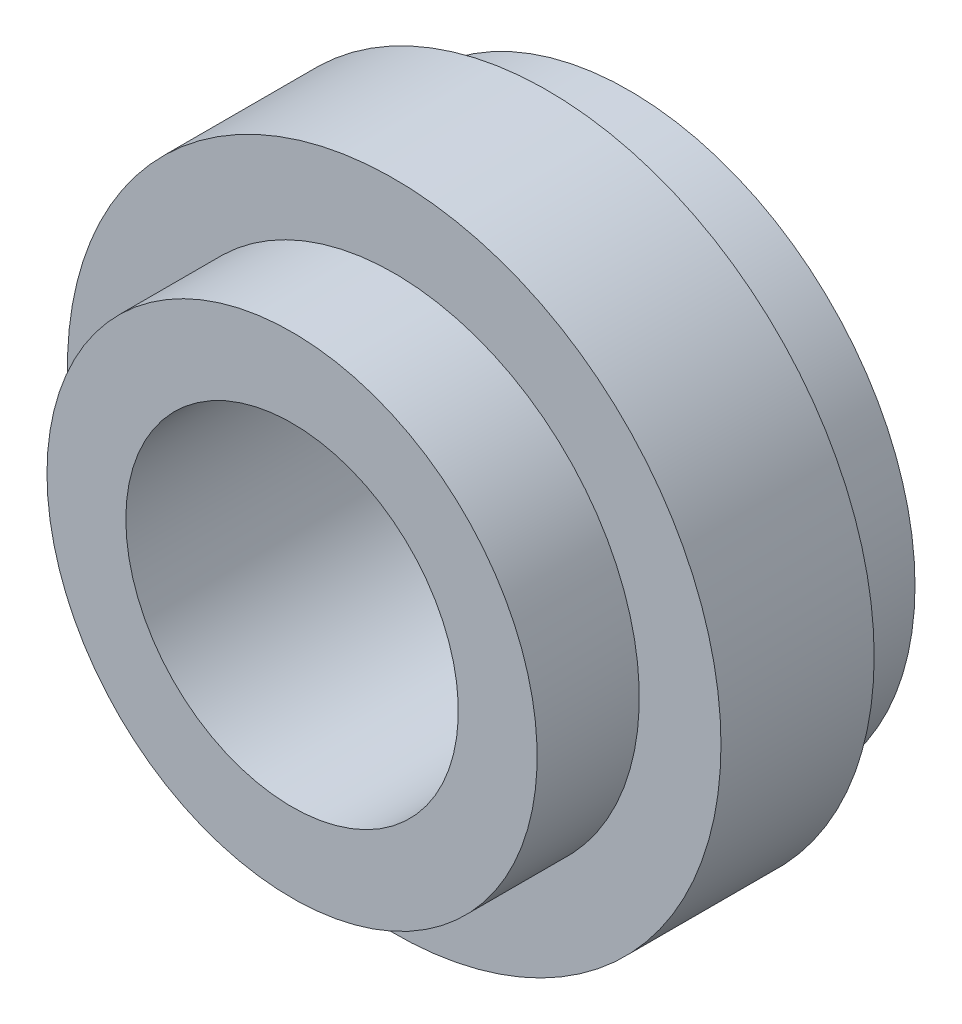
ISO-10303-21;
HEADER;
FILE_DESCRIPTION(('STEP AP214'),'2;1');
FILE_NAME('part.step','',(''),(''),'','','');
FILE_SCHEMA(('AUTOMOTIVE_DESIGN { 1 0 10303 214 1 1 1 1 }'));
ENDSEC;
DATA;
#1=APPLICATION_CONTEXT('core data for automotive mechanical design processes');
#2=APPLICATION_PROTOCOL_DEFINITION('international standard','automotive_design',2000,#1);
#3=PRODUCT_CONTEXT('',#1,'mechanical');
#4=PRODUCT('Part','Part','',(#3));
#5=PRODUCT_RELATED_PRODUCT_CATEGORY('part','',(#4));
#6=PRODUCT_DEFINITION_FORMATION('','',#4);
#7=PRODUCT_DEFINITION_CONTEXT('part definition',#1,'design');
#8=PRODUCT_DEFINITION('design','',#6,#7);
#9=PRODUCT_DEFINITION_SHAPE('','',#8);
#10=(LENGTH_UNIT() NAMED_UNIT(*) SI_UNIT(.MILLI.,.METRE.));
#11=(NAMED_UNIT(*) PLANE_ANGLE_UNIT() SI_UNIT($,.RADIAN.));
#12=(NAMED_UNIT(*) SI_UNIT($,.STERADIAN.) SOLID_ANGLE_UNIT());
#13=UNCERTAINTY_MEASURE_WITH_UNIT(LENGTH_MEASURE(1.E-05),#10,'distance_accuracy_value','');
#14=(GEOMETRIC_REPRESENTATION_CONTEXT(3) GLOBAL_UNCERTAINTY_ASSIGNED_CONTEXT((#13)) GLOBAL_UNIT_ASSIGNED_CONTEXT((#10,
#11,#12)) REPRESENTATION_CONTEXT('',''));
#15=CARTESIAN_POINT('',(0.,0.,0.));
#16=DIRECTION('',(0.,0.,1.));
#17=DIRECTION('',(1.,0.,0.));
#18=AXIS2_PLACEMENT_3D('',#15,#16,#17);
#19=CARTESIAN_POINT('',(0.,0.,-5.75));
#20=DIRECTION('',(0.,0.,-1.));
#21=DIRECTION('',(-1.,0.,0.));
#22=AXIS2_PLACEMENT_3D('',#19,#20,#21);
#23=PLANE('',#22);
#24=CARTESIAN_POINT('',(0.,0.,-5.75));
#25=DIRECTION('',(0.,0.,-1.));
#26=DIRECTION('',(-1.,0.,0.));
#27=AXIS2_PLACEMENT_3D('',#24,#25,#26);
#28=CIRCLE('',#27,4.07);
#29=CARTESIAN_POINT('',(-4.07,0.,-5.75));
#30=VERTEX_POINT('',#29);
#31=EDGE_CURVE('E370',#30,#30,#28,.T.);
#32=ORIENTED_EDGE('',*,*,#31,.F.);
#33=EDGE_LOOP('',(#32));
#34=FACE_BOUND('',#33,.T.);
#35=CARTESIAN_POINT('',(0.,0.,-5.75));
#36=DIRECTION('',(0.,0.,1.));
#37=DIRECTION('',(1.,0.,0.));
#38=AXIS2_PLACEMENT_3D('',#35,#36,#37);
#39=CIRCLE('',#38,7.);
#40=CARTESIAN_POINT('',(7.,0.,-5.75));
#41=VERTEX_POINT('',#40);
#42=EDGE_CURVE('E376',#41,#41,#39,.T.);
#43=ORIENTED_EDGE('',*,*,#42,.F.);
#44=EDGE_LOOP('',(#43));
#45=FACE_BOUND('',#44,.T.);
#46=ADVANCED_FACE('F350',(#34,#45),#23,.T.);
#47=CARTESIAN_POINT('',(0.,0.,-5.75));
#48=DIRECTION('',(0.,0.,1.));
#49=DIRECTION('',(1.,0.,0.));
#50=AXIS2_PLACEMENT_3D('',#47,#48,#49);
#51=CYLINDRICAL_SURFACE('',#50,8.);
#52=CARTESIAN_POINT('',(0.,0.,0.));
#53=DIRECTION('',(0.,0.,-1.));
#54=DIRECTION('',(-1.,0.,0.));
#55=AXIS2_PLACEMENT_3D('',#52,#53,#54);
#56=CIRCLE('',#55,8.);
#57=CARTESIAN_POINT('',(8.,0.,0.));
#58=VERTEX_POINT('',#57);
#59=EDGE_CURVE('E365',#58,#58,#56,.T.);
#60=CARTESIAN_POINT('',(0.,0.,-3.75));
#61=DIRECTION('',(0.,0.,1.));
#62=DIRECTION('',(1.,0.,0.));
#63=AXIS2_PLACEMENT_3D('',#60,#61,#62);
#64=CIRCLE('',#63,8.);
#65=CARTESIAN_POINT('',(8.,0.,-3.75));
#66=VERTEX_POINT('',#65);
#67=EDGE_CURVE('E379',#66,#66,#64,.T.);
#68=CARTESIAN_POINT('',(8.,0.,0.));
#69=CARTESIAN_POINT('',(8.,0.,-0.0390624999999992));
#70=CARTESIAN_POINT('',(8.,0.,-0.0781249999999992));
#71=CARTESIAN_POINT('',(8.,0.,-0.156249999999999));
#72=CARTESIAN_POINT('',(8.,0.,-0.195312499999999));
#73=CARTESIAN_POINT('',(8.,0.,-0.273437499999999));
#74=CARTESIAN_POINT('',(8.,0.,-0.312499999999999));
#75=CARTESIAN_POINT('',(8.,0.,-0.390625));
#76=CARTESIAN_POINT('',(8.,0.,-0.4296875));
#77=CARTESIAN_POINT('',(8.,0.,-0.5078125));
#78=CARTESIAN_POINT('',(8.,0.,-0.546875));
#79=CARTESIAN_POINT('',(8.,0.,-0.625));
#80=CARTESIAN_POINT('',(8.,0.,-0.6640625));
#81=CARTESIAN_POINT('',(8.,0.,-0.7421875));
#82=CARTESIAN_POINT('',(8.,0.,-0.78125));
#83=CARTESIAN_POINT('',(8.,0.,-0.859375));
#84=CARTESIAN_POINT('',(8.,0.,-0.898437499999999));
#85=CARTESIAN_POINT('',(8.,0.,-0.976562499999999));
#86=CARTESIAN_POINT('',(8.,0.,-1.015625));
#87=CARTESIAN_POINT('',(8.,0.,-1.09375));
#88=CARTESIAN_POINT('',(8.,0.,-1.1328125));
#89=CARTESIAN_POINT('',(8.,0.,-1.2109375));
#90=CARTESIAN_POINT('',(8.,0.,-1.25));
#91=CARTESIAN_POINT('',(8.,0.,-1.328125));
#92=CARTESIAN_POINT('',(8.,0.,-1.3671875));
#93=CARTESIAN_POINT('',(8.,0.,-1.4453125));
#94=CARTESIAN_POINT('',(8.,0.,-1.484375));
#95=CARTESIAN_POINT('',(8.,0.,-1.5625));
#96=CARTESIAN_POINT('',(8.,0.,-1.6015625));
#97=CARTESIAN_POINT('',(8.,0.,-1.6796875));
#98=CARTESIAN_POINT('',(8.,0.,-1.71875));
#99=CARTESIAN_POINT('',(8.,0.,-1.796875));
#100=CARTESIAN_POINT('',(8.,0.,-1.8359375));
#101=CARTESIAN_POINT('',(8.,0.,-1.9140625));
#102=CARTESIAN_POINT('',(8.,0.,-1.953125));
#103=CARTESIAN_POINT('',(8.,0.,-2.03125));
#104=CARTESIAN_POINT('',(8.,0.,-2.0703125));
#105=CARTESIAN_POINT('',(8.,0.,-2.1484375));
#106=CARTESIAN_POINT('',(8.,0.,-2.1875));
#107=CARTESIAN_POINT('',(8.,0.,-2.265625));
#108=CARTESIAN_POINT('',(8.,0.,-2.3046875));
#109=CARTESIAN_POINT('',(8.,0.,-2.3828125));
#110=CARTESIAN_POINT('',(8.,0.,-2.421875));
#111=CARTESIAN_POINT('',(8.,0.,-2.5));
#112=CARTESIAN_POINT('',(8.,0.,-2.5390625));
#113=CARTESIAN_POINT('',(8.,0.,-2.6171875));
#114=CARTESIAN_POINT('',(8.,0.,-2.65625));
#115=CARTESIAN_POINT('',(8.,0.,-2.734375));
#116=CARTESIAN_POINT('',(8.,0.,-2.7734375));
#117=CARTESIAN_POINT('',(8.,0.,-2.8515625));
#118=CARTESIAN_POINT('',(8.,0.,-2.890625));
#119=CARTESIAN_POINT('',(8.,0.,-2.96875));
#120=CARTESIAN_POINT('',(8.,0.,-3.0078125));
#121=CARTESIAN_POINT('',(8.,0.,-3.0859375));
#122=CARTESIAN_POINT('',(8.,0.,-3.125));
#123=CARTESIAN_POINT('',(8.,0.,-3.203125));
#124=CARTESIAN_POINT('',(8.,0.,-3.2421875));
#125=CARTESIAN_POINT('',(8.,0.,-3.3203125));
#126=CARTESIAN_POINT('',(8.,0.,-3.359375));
#127=CARTESIAN_POINT('',(8.,0.,-3.4375));
#128=CARTESIAN_POINT('',(8.,0.,-3.4765625));
#129=CARTESIAN_POINT('',(8.,0.,-3.5546875));
#130=CARTESIAN_POINT('',(8.,0.,-3.59375));
#131=CARTESIAN_POINT('',(8.,0.,-3.671875));
#132=CARTESIAN_POINT('',(8.,0.,-3.7109375));
#133=CARTESIAN_POINT('',(8.,0.,-3.75));
#134=B_SPLINE_CURVE_WITH_KNOTS('',3,(#68,#69,#70,#71,#72,#73,#74,#75,#76,#77,#78,#79,#80,#81,
#82,#83,#84,#85,#86,#87,#88,#89,#90,#91,#92,#93,#94,#95,#96,#97,#98,#99,#100,#101,#102,#103,
#104,#105,#106,#107,#108,#109,#110,#111,#112,#113,#114,#115,#116,#117,#118,#119,#120,#121,#122,
#123,#124,#125,#126,#127,#128,#129,#130,#131,#132,#133),.UNSPECIFIED.,.F.,.F.,(4,2,2,2,2,2,2,2,
2,2,2,2,2,2,2,2,2,2,2,2,2,2,2,2,2,2,2,2,2,2,2,2,4),(0.,0.1171875,0.234375,0.3515625,0.46875,
0.585937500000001,0.703125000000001,0.820312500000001,0.9375,1.0546875,1.171875,1.2890625,
1.40625,1.5234375,1.640625,1.7578125,1.875,1.9921875,2.109375,2.2265625,2.34375,2.4609375,
2.578125,2.6953125,2.8125,2.9296875,3.046875,3.1640625,3.28125,3.3984375,3.515625,3.6328125,
3.75),.UNSPECIFIED.);
#135=EDGE_CURVE('BSEAM383',#58,#66,#134,.T.);
#136=ORIENTED_EDGE('',*,*,#59,.T.);
#137=ORIENTED_EDGE('',*,*,#67,.T.);
#138=ORIENTED_EDGE('',*,*,#135,.T.);
#139=ORIENTED_EDGE('',*,*,#135,.F.);
#140=EDGE_LOOP('',(#136,#138,#137,#139));
#141=FACE_BOUND('',#140,.T.);
#142=ADVANCED_FACE('F383',(#141),#51,.T.);
#143=CARTESIAN_POINT('',(0.,0.,2.5));
#144=DIRECTION('',(0.,0.,1.));
#145=DIRECTION('',(1.,0.,0.));
#146=AXIS2_PLACEMENT_3D('',#143,#144,#145);
#147=PLANE('',#146);
#148=CARTESIAN_POINT('',(0.,0.,2.5));
#149=DIRECTION('',(0.,0.,1.));
#150=DIRECTION('',(1.,0.,0.));
#151=AXIS2_PLACEMENT_3D('',#148,#149,#150);
#152=CIRCLE('',#151,6.);
#153=CARTESIAN_POINT('',(-6.,0.,2.5));
#154=VERTEX_POINT('',#153);
#155=EDGE_CURVE('E10',#154,#154,#152,.T.);
#156=ORIENTED_EDGE('',*,*,#155,.T.);
#157=EDGE_LOOP('',(#156));
#158=FACE_BOUND('',#157,.T.);
#159=CARTESIAN_POINT('',(0.,0.,2.5));
#160=DIRECTION('',(0.,0.,1.));
#161=DIRECTION('',(1.,0.,0.));
#162=AXIS2_PLACEMENT_3D('',#159,#160,#161);
#163=CIRCLE('',#162,4.07);
#164=CARTESIAN_POINT('',(-4.07,0.,2.5));
#165=VERTEX_POINT('',#164);
#166=EDGE_CURVE('E357',#165,#165,#163,.T.);
#167=ORIENTED_EDGE('',*,*,#166,.F.);
#168=EDGE_LOOP('',(#167));
#169=FACE_BOUND('',#168,.T.);
#170=ADVANCED_FACE('F406',(#158,#169),#147,.T.);
#171=CARTESIAN_POINT('',(0.,0.,2.5));
#172=DIRECTION('',(0.,0.,-1.));
#173=DIRECTION('',(-1.,0.,0.));
#174=AXIS2_PLACEMENT_3D('',#171,#172,#173);
#175=CYLINDRICAL_SURFACE('',#174,6.);
#176=CARTESIAN_POINT('',(0.,0.,0.));
#177=DIRECTION('',(0.,0.,-1.));
#178=DIRECTION('',(-1.,0.,0.));
#179=AXIS2_PLACEMENT_3D('',#176,#177,#178);
#180=CIRCLE('',#179,6.);
#181=CARTESIAN_POINT('',(-6.,0.,0.));
#182=VERTEX_POINT('',#181);
#183=EDGE_CURVE('E361',#182,#182,#180,.T.);
#184=CARTESIAN_POINT('',(-6.,0.,2.5));
#185=CARTESIAN_POINT('',(-6.,0.,2.47395833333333));
#186=CARTESIAN_POINT('',(-6.,0.,2.44791666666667));
#187=CARTESIAN_POINT('',(-6.,0.,2.39583333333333));
#188=CARTESIAN_POINT('',(-6.,0.,2.36979166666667));
#189=CARTESIAN_POINT('',(-6.,0.,2.31770833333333));
#190=CARTESIAN_POINT('',(-6.,0.,2.29166666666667));
#191=CARTESIAN_POINT('',(-6.,0.,2.23958333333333));
#192=CARTESIAN_POINT('',(-6.,0.,2.21354166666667));
#193=CARTESIAN_POINT('',(-6.,0.,2.16145833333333));
#194=CARTESIAN_POINT('',(-6.,0.,2.13541666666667));
#195=CARTESIAN_POINT('',(-6.,0.,2.08333333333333));
#196=CARTESIAN_POINT('',(-6.,0.,2.05729166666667));
#197=CARTESIAN_POINT('',(-6.,0.,2.00520833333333));
#198=CARTESIAN_POINT('',(-6.,0.,1.97916666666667));
#199=CARTESIAN_POINT('',(-6.,0.,1.92708333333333));
#200=CARTESIAN_POINT('',(-6.,0.,1.90104166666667));
#201=CARTESIAN_POINT('',(-6.,0.,1.84895833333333));
#202=CARTESIAN_POINT('',(-6.,0.,1.82291666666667));
#203=CARTESIAN_POINT('',(-6.,0.,1.77083333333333));
#204=CARTESIAN_POINT('',(-6.,0.,1.74479166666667));
#205=CARTESIAN_POINT('',(-6.,0.,1.69270833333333));
#206=CARTESIAN_POINT('',(-6.,0.,1.66666666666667));
#207=CARTESIAN_POINT('',(-6.,0.,1.61458333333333));
#208=CARTESIAN_POINT('',(-6.,0.,1.58854166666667));
#209=CARTESIAN_POINT('',(-6.,0.,1.53645833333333));
#210=CARTESIAN_POINT('',(-6.,0.,1.51041666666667));
#211=CARTESIAN_POINT('',(-6.,0.,1.45833333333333));
#212=CARTESIAN_POINT('',(-6.,0.,1.43229166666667));
#213=CARTESIAN_POINT('',(-6.,0.,1.38020833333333));
#214=CARTESIAN_POINT('',(-6.,0.,1.35416666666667));
#215=CARTESIAN_POINT('',(-6.,0.,1.30208333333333));
#216=CARTESIAN_POINT('',(-6.,0.,1.27604166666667));
#217=CARTESIAN_POINT('',(-6.,0.,1.22395833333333));
#218=CARTESIAN_POINT('',(-6.,0.,1.19791666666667));
#219=CARTESIAN_POINT('',(-6.,0.,1.14583333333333));
#220=CARTESIAN_POINT('',(-6.,0.,1.11979166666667));
#221=CARTESIAN_POINT('',(-6.,0.,1.06770833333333));
#222=CARTESIAN_POINT('',(-6.,0.,1.04166666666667));
#223=CARTESIAN_POINT('',(-6.,0.,0.989583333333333));
#224=CARTESIAN_POINT('',(-6.,0.,0.963541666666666));
#225=CARTESIAN_POINT('',(-6.,0.,0.911458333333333));
#226=CARTESIAN_POINT('',(-6.,0.,0.885416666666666));
#227=CARTESIAN_POINT('',(-6.,0.,0.833333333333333));
#228=CARTESIAN_POINT('',(-6.,0.,0.807291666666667));
#229=CARTESIAN_POINT('',(-6.,0.,0.755208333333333));
#230=CARTESIAN_POINT('',(-6.,0.,0.729166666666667));
#231=CARTESIAN_POINT('',(-6.,0.,0.677083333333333));
#232=CARTESIAN_POINT('',(-6.,0.,0.651041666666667));
#233=CARTESIAN_POINT('',(-6.,0.,0.598958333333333));
#234=CARTESIAN_POINT('',(-6.,0.,0.572916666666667));
#235=CARTESIAN_POINT('',(-6.,0.,0.520833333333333));
#236=CARTESIAN_POINT('',(-6.,0.,0.494791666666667));
#237=CARTESIAN_POINT('',(-6.,0.,0.442708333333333));
#238=CARTESIAN_POINT('',(-6.,0.,0.416666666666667));
#239=CARTESIAN_POINT('',(-6.,0.,0.364583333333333));
#240=CARTESIAN_POINT('',(-6.,0.,0.338541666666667));
#241=CARTESIAN_POINT('',(-6.,0.,0.286458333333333));
#242=CARTESIAN_POINT('',(-6.,0.,0.260416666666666));
#243=CARTESIAN_POINT('',(-6.,0.,0.208333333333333));
#244=CARTESIAN_POINT('',(-6.,0.,0.182291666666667));
#245=CARTESIAN_POINT('',(-6.,0.,0.130208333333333));
#246=CARTESIAN_POINT('',(-6.,0.,0.104166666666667));
#247=CARTESIAN_POINT('',(-6.,0.,0.0520833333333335));
#248=CARTESIAN_POINT('',(-6.,0.,0.026041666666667));
#249=CARTESIAN_POINT('',(-6.,0.,0.));
#250=B_SPLINE_CURVE_WITH_KNOTS('',3,(#184,#185,#186,#187,#188,#189,#190,#191,#192,#193,#194,
#195,#196,#197,#198,#199,#200,#201,#202,#203,#204,#205,#206,#207,#208,#209,#210,#211,#212,#213,
#214,#215,#216,#217,#218,#219,#220,#221,#222,#223,#224,#225,#226,#227,#228,#229,#230,#231,#232,
#233,#234,#235,#236,#237,#238,#239,#240,#241,#242,#243,#244,#245,#246,#247,#248,#249),
.UNSPECIFIED.,.F.,.F.,(4,2,2,2,2,2,2,2,2,2,2,2,2,2,2,2,2,2,2,2,2,2,2,2,2,2,2,2,2,2,2,2,4),(0.,
0.0781249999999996,0.15625,0.234375,0.312499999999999,0.390625,0.46875,0.546874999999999,
0.624999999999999,0.703124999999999,0.781249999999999,0.859374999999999,0.937499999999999,
1.015625,1.09375,1.171875,1.25,1.328125,1.40625,1.484375,1.5625,1.640625,1.71875,1.796875,1.875,
1.953125,2.03125,2.109375,2.1875,2.265625,2.34375,2.421875,2.5),.UNSPECIFIED.);
#251=EDGE_CURVE('BSEAM352',#154,#182,#250,.T.);
#252=ORIENTED_EDGE('',*,*,#155,.F.);
#253=ORIENTED_EDGE('',*,*,#183,.F.);
#254=ORIENTED_EDGE('',*,*,#251,.T.);
#255=ORIENTED_EDGE('',*,*,#251,.F.);
#256=EDGE_LOOP('',(#252,#254,#253,#255));
#257=FACE_BOUND('',#256,.T.);
#258=ADVANCED_FACE('F352',(#257),#175,.T.);
#259=CARTESIAN_POINT('',(0.,0.,2.5));
#260=DIRECTION('',(0.,0.,-1.));
#261=DIRECTION('',(-1.,0.,0.));
#262=AXIS2_PLACEMENT_3D('',#259,#260,#261);
#263=CYLINDRICAL_SURFACE('',#262,4.07);
#264=CARTESIAN_POINT('',(-4.07,0.,2.5));
#265=CARTESIAN_POINT('',(-4.07,0.,2.4140625));
#266=CARTESIAN_POINT('',(-4.07,0.,2.328125));
#267=CARTESIAN_POINT('',(-4.07,0.,2.15625));
#268=CARTESIAN_POINT('',(-4.07,0.,2.0703125));
#269=CARTESIAN_POINT('',(-4.07,0.,1.8984375));
#270=CARTESIAN_POINT('',(-4.07,0.,1.8125));
#271=CARTESIAN_POINT('',(-4.07,0.,1.640625));
#272=CARTESIAN_POINT('',(-4.07,0.,1.5546875));
#273=CARTESIAN_POINT('',(-4.07,0.,1.3828125));
#274=CARTESIAN_POINT('',(-4.07,0.,1.296875));
#275=CARTESIAN_POINT('',(-4.07,0.,1.125));
#276=CARTESIAN_POINT('',(-4.07,0.,1.0390625));
#277=CARTESIAN_POINT('',(-4.07,0.,0.867187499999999));
#278=CARTESIAN_POINT('',(-4.07,0.,0.781249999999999));
#279=CARTESIAN_POINT('',(-4.07,0.,0.609374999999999));
#280=CARTESIAN_POINT('',(-4.07,0.,0.523437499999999));
#281=CARTESIAN_POINT('',(-4.07,0.,0.351562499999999));
#282=CARTESIAN_POINT('',(-4.07,0.,0.265624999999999));
#283=CARTESIAN_POINT('',(-4.07,0.,0.0937499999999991));
#284=CARTESIAN_POINT('',(-4.07,0.,0.0078124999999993));
#285=CARTESIAN_POINT('',(-4.07,0.,-0.1640625));
#286=CARTESIAN_POINT('',(-4.07,0.,-0.25));
#287=CARTESIAN_POINT('',(-4.07,0.,-0.421875));
#288=CARTESIAN_POINT('',(-4.07,0.,-0.5078125));
#289=CARTESIAN_POINT('',(-4.07,0.,-0.679687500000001));
#290=CARTESIAN_POINT('',(-4.07,0.,-0.765625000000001));
#291=CARTESIAN_POINT('',(-4.07,0.,-0.937500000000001));
#292=CARTESIAN_POINT('',(-4.07,0.,-1.0234375));
#293=CARTESIAN_POINT('',(-4.07,0.,-1.1953125));
#294=CARTESIAN_POINT('',(-4.07,0.,-1.28125));
#295=CARTESIAN_POINT('',(-4.07,0.,-1.453125));
#296=CARTESIAN_POINT('',(-4.07,0.,-1.5390625));
#297=CARTESIAN_POINT('',(-4.07,0.,-1.7109375));
#298=CARTESIAN_POINT('',(-4.07,0.,-1.796875));
#299=CARTESIAN_POINT('',(-4.07,0.,-1.96875));
#300=CARTESIAN_POINT('',(-4.07,0.,-2.0546875));
#301=CARTESIAN_POINT('',(-4.07,0.,-2.2265625));
#302=CARTESIAN_POINT('',(-4.07,0.,-2.3125));
#303=CARTESIAN_POINT('',(-4.07,0.,-2.484375));
#304=CARTESIAN_POINT('',(-4.07,0.,-2.5703125));
#305=CARTESIAN_POINT('',(-4.07,0.,-2.7421875));
#306=CARTESIAN_POINT('',(-4.07,0.,-2.828125));
#307=CARTESIAN_POINT('',(-4.07,0.,-3.));
#308=CARTESIAN_POINT('',(-4.07,0.,-3.0859375));
#309=CARTESIAN_POINT('',(-4.07,0.,-3.2578125));
#310=CARTESIAN_POINT('',(-4.07,0.,-3.34375));
#311=CARTESIAN_POINT('',(-4.07,0.,-3.515625));
#312=CARTESIAN_POINT('',(-4.07,0.,-3.6015625));
#313=CARTESIAN_POINT('',(-4.07,0.,-3.7734375));
#314=CARTESIAN_POINT('',(-4.07,0.,-3.859375));
#315=CARTESIAN_POINT('',(-4.07,0.,-4.03125));
#316=CARTESIAN_POINT('',(-4.07,0.,-4.1171875));
#317=CARTESIAN_POINT('',(-4.07,0.,-4.2890625));
#318=CARTESIAN_POINT('',(-4.07,0.,-4.375));
#319=CARTESIAN_POINT('',(-4.07,0.,-4.546875));
#320=CARTESIAN_POINT('',(-4.07,0.,-4.6328125));
#321=CARTESIAN_POINT('',(-4.07,0.,-4.8046875));
#322=CARTESIAN_POINT('',(-4.07,0.,-4.890625));
#323=CARTESIAN_POINT('',(-4.07,0.,-5.0625));
#324=CARTESIAN_POINT('',(-4.07,0.,-5.1484375));
#325=CARTESIAN_POINT('',(-4.07,0.,-5.3203125));
#326=CARTESIAN_POINT('',(-4.07,0.,-5.40625));
#327=CARTESIAN_POINT('',(-4.07,0.,-5.578125));
#328=CARTESIAN_POINT('',(-4.07,0.,-5.6640625));
#329=CARTESIAN_POINT('',(-4.07,0.,-5.75));
#330=B_SPLINE_CURVE_WITH_KNOTS('',3,(#264,#265,#266,#267,#268,#269,#270,#271,#272,#273,#274,
#275,#276,#277,#278,#279,#280,#281,#282,#283,#284,#285,#286,#287,#288,#289,#290,#291,#292,#293,
#294,#295,#296,#297,#298,#299,#300,#301,#302,#303,#304,#305,#306,#307,#308,#309,#310,#311,#312,
#313,#314,#315,#316,#317,#318,#319,#320,#321,#322,#323,#324,#325,#326,#327,#328,#329),
.UNSPECIFIED.,.F.,.F.,(4,2,2,2,2,2,2,2,2,2,2,2,2,2,2,2,2,2,2,2,2,2,2,2,2,2,2,2,2,2,2,2,4),(0.,
0.2578125,0.515625,0.773437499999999,1.03125,1.2890625,1.546875,1.8046875,2.0625,2.3203125,
2.578125,2.8359375,3.09375,3.3515625,3.609375,3.8671875,4.125,4.3828125,4.640625,4.8984375,
5.15625,5.4140625,5.671875,5.9296875,6.1875,6.4453125,6.703125,6.9609375,7.21875,7.4765625,
7.734375,7.9921875,8.25),.UNSPECIFIED.);
#331=EDGE_CURVE('BSEAM397',#165,#30,#330,.T.);
#332=ORIENTED_EDGE('',*,*,#166,.T.);
#333=ORIENTED_EDGE('',*,*,#31,.T.);
#334=ORIENTED_EDGE('',*,*,#331,.T.);
#335=ORIENTED_EDGE('',*,*,#331,.F.);
#336=EDGE_LOOP('',(#332,#334,#333,#335));
#337=FACE_BOUND('',#336,.T.);
#338=ADVANCED_FACE('F397',(#337),#263,.F.);
#339=CARTESIAN_POINT('',(0.,0.,0.));
#340=DIRECTION('',(0.,0.,-1.));
#341=DIRECTION('',(-1.,0.,0.));
#342=AXIS2_PLACEMENT_3D('',#339,#340,#341);
#343=PLANE('',#342);
#344=ORIENTED_EDGE('',*,*,#59,.F.);
#345=EDGE_LOOP('',(#344));
#346=FACE_BOUND('',#345,.T.);
#347=ORIENTED_EDGE('',*,*,#183,.T.);
#348=EDGE_LOOP('',(#347));
#349=FACE_BOUND('',#348,.T.);
#350=ADVANCED_FACE('F388',(#346,#349),#343,.F.);
#351=CARTESIAN_POINT('',(0.,8.,-3.75));
#352=DIRECTION('',(0.,0.,-1.));
#353=DIRECTION('',(-1.,0.,0.));
#354=AXIS2_PLACEMENT_3D('',#351,#352,#353);
#355=PLANE('',#354);
#356=CARTESIAN_POINT('',(0.,0.,-3.75));
#357=DIRECTION('',(0.,0.,1.));
#358=DIRECTION('',(1.,0.,0.));
#359=AXIS2_PLACEMENT_3D('',#356,#357,#358);
#360=CIRCLE('',#359,7.);
#361=CARTESIAN_POINT('',(7.,0.,-3.75));
#362=VERTEX_POINT('',#361);
#363=EDGE_CURVE('E373',#362,#362,#360,.T.);
#364=ORIENTED_EDGE('',*,*,#363,.T.);
#365=EDGE_LOOP('',(#364));
#366=FACE_BOUND('',#365,.T.);
#367=ORIENTED_EDGE('',*,*,#67,.F.);
#368=EDGE_LOOP('',(#367));
#369=FACE_BOUND('',#368,.T.);
#370=ADVANCED_FACE('F385',(#366,#369),#355,.T.);
#371=CARTESIAN_POINT('',(0.,0.,0.));
#372=DIRECTION('',(0.,0.,1.));
#373=DIRECTION('',(1.,0.,0.));
#374=AXIS2_PLACEMENT_3D('',#371,#372,#373);
#375=CYLINDRICAL_SURFACE('',#374,7.);
#376=CARTESIAN_POINT('',(7.,0.,-5.75));
#377=CARTESIAN_POINT('',(7.,0.,-5.72916666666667));
#378=CARTESIAN_POINT('',(7.,0.,-5.70833333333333));
#379=CARTESIAN_POINT('',(7.,0.,-5.66666666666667));
#380=CARTESIAN_POINT('',(7.,0.,-5.64583333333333));
#381=CARTESIAN_POINT('',(7.,0.,-5.60416666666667));
#382=CARTESIAN_POINT('',(7.,0.,-5.58333333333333));
#383=CARTESIAN_POINT('',(7.,0.,-5.54166666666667));
#384=CARTESIAN_POINT('',(7.,0.,-5.52083333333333));
#385=CARTESIAN_POINT('',(7.,0.,-5.47916666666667));
#386=CARTESIAN_POINT('',(7.,0.,-5.45833333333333));
#387=CARTESIAN_POINT('',(7.,0.,-5.41666666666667));
#388=CARTESIAN_POINT('',(7.,0.,-5.39583333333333));
#389=CARTESIAN_POINT('',(7.,0.,-5.35416666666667));
#390=CARTESIAN_POINT('',(7.,0.,-5.33333333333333));
#391=CARTESIAN_POINT('',(7.,0.,-5.29166666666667));
#392=CARTESIAN_POINT('',(7.,0.,-5.27083333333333));
#393=CARTESIAN_POINT('',(7.,0.,-5.22916666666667));
#394=CARTESIAN_POINT('',(7.,0.,-5.20833333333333));
#395=CARTESIAN_POINT('',(7.,0.,-5.16666666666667));
#396=CARTESIAN_POINT('',(7.,0.,-5.14583333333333));
#397=CARTESIAN_POINT('',(7.,0.,-5.10416666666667));
#398=CARTESIAN_POINT('',(7.,0.,-5.08333333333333));
#399=CARTESIAN_POINT('',(7.,0.,-5.04166666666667));
#400=CARTESIAN_POINT('',(7.,0.,-5.02083333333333));
#401=CARTESIAN_POINT('',(7.,0.,-4.97916666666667));
#402=CARTESIAN_POINT('',(7.,0.,-4.95833333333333));
#403=CARTESIAN_POINT('',(7.,0.,-4.91666666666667));
#404=CARTESIAN_POINT('',(7.,0.,-4.89583333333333));
#405=CARTESIAN_POINT('',(7.,0.,-4.85416666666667));
#406=CARTESIAN_POINT('',(7.,0.,-4.83333333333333));
#407=CARTESIAN_POINT('',(7.,0.,-4.79166666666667));
#408=CARTESIAN_POINT('',(7.,0.,-4.77083333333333));
#409=CARTESIAN_POINT('',(7.,0.,-4.72916666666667));
#410=CARTESIAN_POINT('',(7.,0.,-4.70833333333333));
#411=CARTESIAN_POINT('',(7.,0.,-4.66666666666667));
#412=CARTESIAN_POINT('',(7.,0.,-4.64583333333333));
#413=CARTESIAN_POINT('',(7.,0.,-4.60416666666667));
#414=CARTESIAN_POINT('',(7.,0.,-4.58333333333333));
#415=CARTESIAN_POINT('',(7.,0.,-4.54166666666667));
#416=CARTESIAN_POINT('',(7.,0.,-4.52083333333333));
#417=CARTESIAN_POINT('',(7.,0.,-4.47916666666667));
#418=CARTESIAN_POINT('',(7.,0.,-4.45833333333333));
#419=CARTESIAN_POINT('',(7.,0.,-4.41666666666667));
#420=CARTESIAN_POINT('',(7.,0.,-4.39583333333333));
#421=CARTESIAN_POINT('',(7.,0.,-4.35416666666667));
#422=CARTESIAN_POINT('',(7.,0.,-4.33333333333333));
#423=CARTESIAN_POINT('',(7.,0.,-4.29166666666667));
#424=CARTESIAN_POINT('',(7.,0.,-4.27083333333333));
#425=CARTESIAN_POINT('',(7.,0.,-4.22916666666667));
#426=CARTESIAN_POINT('',(7.,0.,-4.20833333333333));
#427=CARTESIAN_POINT('',(7.,0.,-4.16666666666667));
#428=CARTESIAN_POINT('',(7.,0.,-4.14583333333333));
#429=CARTESIAN_POINT('',(7.,0.,-4.10416666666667));
#430=CARTESIAN_POINT('',(7.,0.,-4.08333333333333));
#431=CARTESIAN_POINT('',(7.,0.,-4.04166666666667));
#432=CARTESIAN_POINT('',(7.,0.,-4.02083333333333));
#433=CARTESIAN_POINT('',(7.,0.,-3.97916666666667));
#434=CARTESIAN_POINT('',(7.,0.,-3.95833333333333));
#435=CARTESIAN_POINT('',(7.,0.,-3.91666666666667));
#436=CARTESIAN_POINT('',(7.,0.,-3.89583333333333));
#437=CARTESIAN_POINT('',(7.,0.,-3.85416666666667));
#438=CARTESIAN_POINT('',(7.,0.,-3.83333333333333));
#439=CARTESIAN_POINT('',(7.,0.,-3.79166666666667));
#440=CARTESIAN_POINT('',(7.,0.,-3.77083333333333));
#441=CARTESIAN_POINT('',(7.,0.,-3.75));
#442=B_SPLINE_CURVE_WITH_KNOTS('',3,(#376,#377,#378,#379,#380,#381,#382,#383,#384,#385,#386,
#387,#388,#389,#390,#391,#392,#393,#394,#395,#396,#397,#398,#399,#400,#401,#402,#403,#404,#405,
#406,#407,#408,#409,#410,#411,#412,#413,#414,#415,#416,#417,#418,#419,#420,#421,#422,#423,#424,
#425,#426,#427,#428,#429,#430,#431,#432,#433,#434,#435,#436,#437,#438,#439,#440,#441),
.UNSPECIFIED.,.F.,.F.,(4,2,2,2,2,2,2,2,2,2,2,2,2,2,2,2,2,2,2,2,2,2,2,2,2,2,2,2,2,2,2,2,4),(0.,
0.0625000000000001,0.125,0.1875,0.25,0.3125,0.375,0.4375,0.5,0.5625,0.625,0.6875,0.75,0.8125,
0.874999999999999,0.937499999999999,0.999999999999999,1.0625,1.125,1.1875,1.25,1.3125,1.375,
1.4375,1.5,1.5625,1.625,1.6875,1.75,1.8125,1.875,1.9375,2.),.UNSPECIFIED.);
#443=EDGE_CURVE('BSEAM387',#41,#362,#442,.T.);
#444=ORIENTED_EDGE('',*,*,#42,.T.);
#445=ORIENTED_EDGE('',*,*,#363,.F.);
#446=ORIENTED_EDGE('',*,*,#443,.T.);
#447=ORIENTED_EDGE('',*,*,#443,.F.);
#448=EDGE_LOOP('',(#444,#446,#445,#447));
#449=FACE_BOUND('',#448,.T.);
#450=ADVANCED_FACE('F387',(#449),#375,.T.);
#451=CLOSED_SHELL('',(#46,#142,#170,#258,#338,#350,#370,#450));
#452=MANIFOLD_SOLID_BREP('B2',#451);
#453=ADVANCED_BREP_SHAPE_REPRESENTATION('',(#18,#452),#14);
#454=SHAPE_DEFINITION_REPRESENTATION(#9,#453);
ENDSEC;
END-ISO-10303-21;
